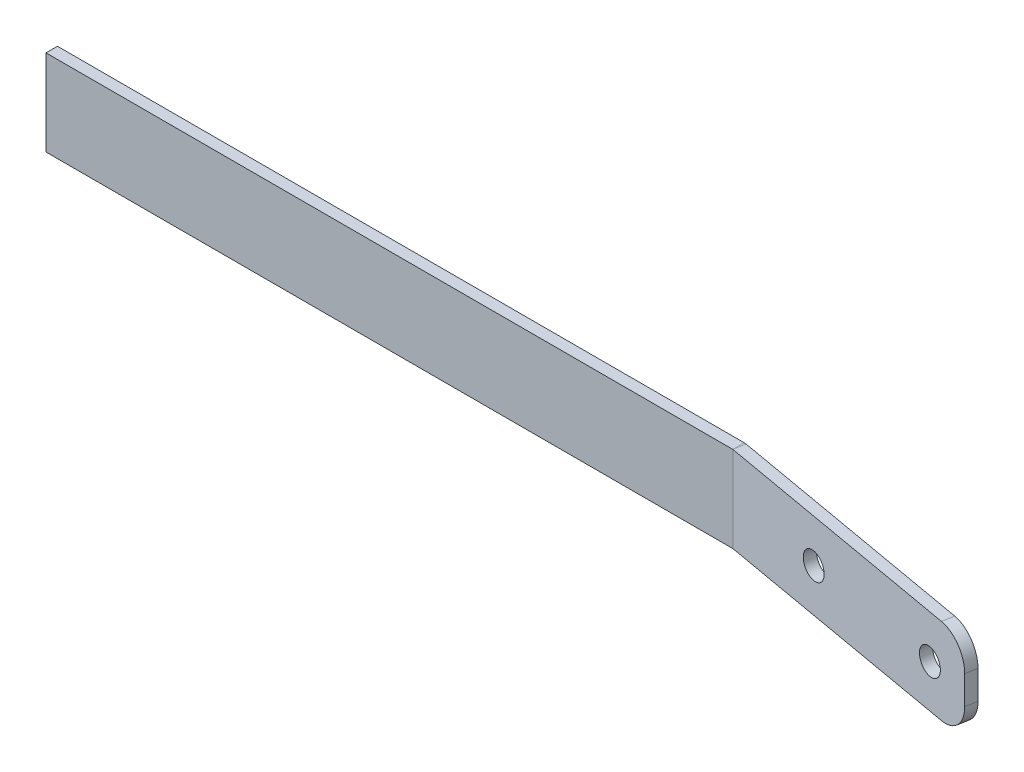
ISO-10303-21;
HEADER;
FILE_DESCRIPTION(('STEP AP214'),'2;1');
FILE_NAME('part.step','',(''),(''),'','','');
FILE_SCHEMA(('AUTOMOTIVE_DESIGN { 1 0 10303 214 1 1 1 1 }'));
ENDSEC;
DATA;
#1=APPLICATION_CONTEXT('core data for automotive mechanical design processes');
#2=APPLICATION_PROTOCOL_DEFINITION('international standard','automotive_design',2000,#1);
#3=PRODUCT_CONTEXT('',#1,'mechanical');
#4=PRODUCT('Part','Part','',(#3));
#5=PRODUCT_RELATED_PRODUCT_CATEGORY('part','',(#4));
#6=PRODUCT_DEFINITION_FORMATION('','',#4);
#7=PRODUCT_DEFINITION_CONTEXT('part definition',#1,'design');
#8=PRODUCT_DEFINITION('design','',#6,#7);
#9=PRODUCT_DEFINITION_SHAPE('','',#8);
#10=(LENGTH_UNIT() NAMED_UNIT(*) SI_UNIT(.MILLI.,.METRE.));
#11=(NAMED_UNIT(*) PLANE_ANGLE_UNIT() SI_UNIT($,.RADIAN.));
#12=(NAMED_UNIT(*) SI_UNIT($,.STERADIAN.) SOLID_ANGLE_UNIT());
#13=UNCERTAINTY_MEASURE_WITH_UNIT(LENGTH_MEASURE(1.E-05),#10,'distance_accuracy_value','');
#14=(GEOMETRIC_REPRESENTATION_CONTEXT(3) GLOBAL_UNCERTAINTY_ASSIGNED_CONTEXT((#13)) GLOBAL_UNIT_ASSIGNED_CONTEXT((#10,
#11,#12)) REPRESENTATION_CONTEXT('',''));
#15=CARTESIAN_POINT('',(0.,0.,0.));
#16=DIRECTION('',(0.,0.,1.));
#17=DIRECTION('',(1.,0.,0.));
#18=AXIS2_PLACEMENT_3D('',#15,#16,#17);
#19=CARTESIAN_POINT('',(3.28628346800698,-15.,17.59802866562));
#20=DIRECTION('',(0.,-1.,0.));
#21=DIRECTION('',(0.984807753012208,0.,0.173648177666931));
#22=AXIS2_PLACEMENT_3D('',#19,#20,#21);
#23=PLANE('',#22);
#24=DIRECTION('',(-0.984807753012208,0.,-0.173648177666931));
#25=VECTOR('',#24,1.);
#26=CARTESIAN_POINT('',(3.28628346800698,-15.,17.59802866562));
#27=LINE('',#26,#25);
#28=CARTESIAN_POINT('',(3.28628346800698,-15.,17.59802866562));
#29=VERTEX_POINT('',#28);
#30=CARTESIAN_POINT('',(-85.1745329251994,-15.,2.));
#31=VERTEX_POINT('',#30);
#32=EDGE_CURVE('E145',#29,#31,#27,.T.);
#33=ORIENTED_EDGE('',*,*,#32,.T.);
#34=DIRECTION('',(0.173648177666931,0.,-0.984807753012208));
#35=VECTOR('',#34,1.);
#36=CARTESIAN_POINT('',(-85.1745329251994,-15.,2.));
#37=LINE('',#36,#35);
#38=CARTESIAN_POINT('',(-84.4799402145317,-15.,-1.93923101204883));
#39=VERTEX_POINT('',#38);
#40=EDGE_CURVE('E11',#31,#39,#37,.T.);
#41=ORIENTED_EDGE('',*,*,#40,.T.);
#42=DIRECTION('',(-0.984807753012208,0.,-0.173648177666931));
#43=VECTOR('',#42,1.);
#44=CARTESIAN_POINT('',(3.9808761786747,-15.,13.6587976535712));
#45=LINE('',#44,#43);
#46=CARTESIAN_POINT('',(3.9808761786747,-15.,13.6587976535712));
#47=VERTEX_POINT('',#46);
#48=EDGE_CURVE('E166',#47,#39,#45,.T.);
#49=ORIENTED_EDGE('',*,*,#48,.F.);
#50=DIRECTION('',(0.173648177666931,0.,-0.984807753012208));
#51=VECTOR('',#50,1.);
#52=CARTESIAN_POINT('',(3.28628346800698,-15.,17.59802866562));
#53=LINE('',#52,#51);
#54=EDGE_CURVE('E155',#29,#47,#53,.T.);
#55=ORIENTED_EDGE('',*,*,#54,.F.);
#56=EDGE_LOOP('',(#33,#41,#49,#55));
#57=FACE_BOUND('',#56,.T.);
#58=ADVANCED_FACE('F30',(#57),#23,.T.);
#59=CARTESIAN_POINT('',(-321.700275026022,14.9999999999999,-39.7058699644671));
#60=DIRECTION('',(0.,1.,0.));
#61=DIRECTION('',(-0.984807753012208,0.,-0.173648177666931));
#62=AXIS2_PLACEMENT_3D('',#59,#60,#61);
#63=PLANE('',#62);
#64=DIRECTION('',(0.984807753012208,0.,0.173648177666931));
#65=VECTOR('',#64,1.);
#66=CARTESIAN_POINT('',(-321.005682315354,14.9999999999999,-43.645100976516));
#67=LINE('',#66,#65);
#68=CARTESIAN_POINT('',(-84.4799402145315,14.9999999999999,-1.9392310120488));
#69=VERTEX_POINT('',#68);
#70=CARTESIAN_POINT('',(3.9808761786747,14.9999999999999,13.6587976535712));
#71=VERTEX_POINT('',#70);
#72=EDGE_CURVE('E138',#69,#71,#67,.T.);
#73=ORIENTED_EDGE('',*,*,#72,.F.);
#74=DIRECTION('',(-0.173648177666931,0.,0.984807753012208));
#75=VECTOR('',#74,1.);
#76=CARTESIAN_POINT('',(-85.1745329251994,14.9999999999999,2.));
#77=LINE('',#76,#75);
#78=CARTESIAN_POINT('',(-85.1745329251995,14.9999999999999,1.99999999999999));
#79=VERTEX_POINT('',#78);
#80=EDGE_CURVE('E38',#69,#79,#77,.T.);
#81=ORIENTED_EDGE('',*,*,#80,.T.);
#82=DIRECTION('',(0.984807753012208,0.,0.173648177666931));
#83=VECTOR('',#82,1.);
#84=CARTESIAN_POINT('',(-321.700275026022,14.9999999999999,-39.7058699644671));
#85=LINE('',#84,#83);
#86=CARTESIAN_POINT('',(3.28628346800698,14.9999999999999,17.59802866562));
#87=VERTEX_POINT('',#86);
#88=EDGE_CURVE('E53',#79,#87,#85,.T.);
#89=ORIENTED_EDGE('',*,*,#88,.T.);
#90=DIRECTION('',(0.173648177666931,0.,-0.984807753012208));
#91=VECTOR('',#90,1.);
#92=CARTESIAN_POINT('',(3.28628346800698,14.9999999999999,17.59802866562));
#93=LINE('',#92,#91);
#94=EDGE_CURVE('E153',#87,#71,#93,.T.);
#95=ORIENTED_EDGE('',*,*,#94,.T.);
#96=EDGE_LOOP('',(#73,#81,#89,#95));
#97=FACE_BOUND('',#96,.T.);
#98=ADVANCED_FACE('F137',(#97),#63,.T.);
#99=CARTESIAN_POINT('',(3.9808761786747,4.99999999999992,13.6587976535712));
#100=DIRECTION('',(0.173648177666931,0.,-0.984807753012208));
#101=DIRECTION('',(-0.984807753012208,0.,-0.173648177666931));
#102=AXIS2_PLACEMENT_3D('',#99,#100,#101);
#103=PLANE('',#102);
#104=CARTESIAN_POINT('',(-50.1835502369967,0.,4.10814788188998));
#105=DIRECTION('',(-0.173648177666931,0.,0.984807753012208));
#106=DIRECTION('',(0.984807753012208,0.,0.173648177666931));
#107=AXIS2_PLACEMENT_3D('',#104,#105,#106);
#108=CIRCLE('',#107,4.5);
#109=CARTESIAN_POINT('',(-45.7519153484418,0.,4.88956468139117));
#110=VERTEX_POINT('',#109);
#111=EDGE_CURVE('E174',#110,#110,#108,.T.);
#112=ORIENTED_EDGE('',*,*,#111,.T.);
#113=EDGE_LOOP('',(#112));
#114=FACE_BOUND('',#113,.T.);
#115=CARTESIAN_POINT('',(-0.943162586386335,0.,12.7905567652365));
#116=DIRECTION('',(-0.173648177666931,0.,0.984807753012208));
#117=DIRECTION('',(0.984807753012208,0.,0.173648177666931));
#118=AXIS2_PLACEMENT_3D('',#115,#116,#117);
#119=CIRCLE('',#118,4.5);
#120=CARTESIAN_POINT('',(3.4884723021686,0.,13.5719735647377));
#121=VERTEX_POINT('',#120);
#122=EDGE_CURVE('E183',#121,#121,#119,.T.);
#123=ORIENTED_EDGE('',*,*,#122,.T.);
#124=EDGE_LOOP('',(#123));
#125=FACE_BOUND('',#124,.T.);
#126=ORIENTED_EDGE('',*,*,#48,.T.);
#127=DIRECTION('',(0.,1.,0.));
#128=VECTOR('',#127,1.);
#129=CARTESIAN_POINT('',(-84.4799402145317,4.99999999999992,-1.93923101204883));
#130=LINE('',#129,#128);
#131=EDGE_CURVE('E126',#39,#69,#130,.T.);
#132=ORIENTED_EDGE('',*,*,#131,.T.);
#133=ORIENTED_EDGE('',*,*,#72,.T.);
#134=CARTESIAN_POINT('',(3.9808761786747,4.99999999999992,13.6587976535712));
#135=DIRECTION('',(0.173648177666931,0.,-0.984807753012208));
#136=DIRECTION('',(-0.984807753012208,0.,-0.173648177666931));
#137=AXIS2_PLACEMENT_3D('',#134,#135,#136);
#138=CIRCLE('',#137,10.);
#139=CARTESIAN_POINT('',(13.8289537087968,4.99999999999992,15.3952794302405));
#140=VERTEX_POINT('',#139);
#141=EDGE_CURVE('E189',#71,#140,#138,.T.);
#142=ORIENTED_EDGE('',*,*,#141,.T.);
#143=DIRECTION('',(0.,1.,0.));
#144=VECTOR('',#143,1.);
#145=CARTESIAN_POINT('',(13.8289537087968,-4.99999999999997,15.3952794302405));
#146=LINE('',#145,#144);
#147=CARTESIAN_POINT('',(13.8289537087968,-4.99999999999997,15.3952794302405));
#148=VERTEX_POINT('',#147);
#149=EDGE_CURVE('E191',#148,#140,#146,.T.);
#150=ORIENTED_EDGE('',*,*,#149,.F.);
#151=CARTESIAN_POINT('',(3.9808761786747,-4.99999999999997,13.6587976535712));
#152=DIRECTION('',(-0.173648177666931,0.,0.984807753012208));
#153=DIRECTION('',(0.984807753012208,0.,0.173648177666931));
#154=AXIS2_PLACEMENT_3D('',#151,#152,#153);
#155=CIRCLE('',#154,10.);
#156=EDGE_CURVE('E194',#47,#148,#155,.T.);
#157=ORIENTED_EDGE('',*,*,#156,.F.);
#158=EDGE_LOOP('',(#126,#132,#133,#142,#150,#157));
#159=FACE_BOUND('',#158,.T.);
#160=ADVANCED_FACE('F162',(#114,#125,#159),#103,.T.);
#161=CARTESIAN_POINT('',(3.28628346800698,4.99999999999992,17.59802866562));
#162=DIRECTION('',(0.173648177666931,0.,-0.984807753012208));
#163=DIRECTION('',(-0.984807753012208,0.,-0.173648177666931));
#164=AXIS2_PLACEMENT_3D('',#161,#162,#163);
#165=PLANE('',#164);
#166=DIRECTION('',(0.,1.,0.));
#167=VECTOR('',#166,1.);
#168=CARTESIAN_POINT('',(-85.1745329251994,4.99999999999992,2.));
#169=LINE('',#168,#167);
#170=EDGE_CURVE('E120',#31,#79,#169,.T.);
#171=ORIENTED_EDGE('',*,*,#170,.F.);
#172=ORIENTED_EDGE('',*,*,#32,.F.);
#173=CARTESIAN_POINT('',(3.28628346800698,-4.99999999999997,17.59802866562));
#174=DIRECTION('',(-0.173648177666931,0.,0.984807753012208));
#175=DIRECTION('',(0.984807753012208,0.,0.173648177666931));
#176=AXIS2_PLACEMENT_3D('',#173,#174,#175);
#177=CIRCLE('',#176,10.);
#178=CARTESIAN_POINT('',(13.1343609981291,-4.99999999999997,19.3345104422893));
#179=VERTEX_POINT('',#178);
#180=EDGE_CURVE('E149',#29,#179,#177,.T.);
#181=ORIENTED_EDGE('',*,*,#180,.T.);
#182=DIRECTION('',(0.,1.,0.));
#183=VECTOR('',#182,1.);
#184=CARTESIAN_POINT('',(13.1343609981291,-4.99999999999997,19.3345104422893));
#185=LINE('',#184,#183);
#186=CARTESIAN_POINT('',(13.1343609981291,4.99999999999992,19.3345104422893));
#187=VERTEX_POINT('',#186);
#188=EDGE_CURVE('E199',#179,#187,#185,.T.);
#189=ORIENTED_EDGE('',*,*,#188,.T.);
#190=CARTESIAN_POINT('',(3.28628346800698,4.99999999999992,17.59802866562));
#191=DIRECTION('',(0.173648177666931,0.,-0.984807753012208));
#192=DIRECTION('',(-0.984807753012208,0.,-0.173648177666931));
#193=AXIS2_PLACEMENT_3D('',#190,#191,#192);
#194=CIRCLE('',#193,10.);
#195=EDGE_CURVE('E143',#87,#187,#194,.T.);
#196=ORIENTED_EDGE('',*,*,#195,.F.);
#197=ORIENTED_EDGE('',*,*,#88,.F.);
#198=EDGE_LOOP('',(#171,#172,#181,#189,#196,#197));
#199=FACE_BOUND('',#198,.T.);
#200=CARTESIAN_POINT('',(-1.63775529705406,0.,16.7297877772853));
#201=DIRECTION('',(-0.173648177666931,0.,0.984807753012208));
#202=DIRECTION('',(0.984807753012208,0.,0.173648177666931));
#203=AXIS2_PLACEMENT_3D('',#200,#201,#202);
#204=CIRCLE('',#203,4.5);
#205=CARTESIAN_POINT('',(2.79387959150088,0.,17.5112045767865));
#206=VERTEX_POINT('',#205);
#207=EDGE_CURVE('E186',#206,#206,#204,.T.);
#208=ORIENTED_EDGE('',*,*,#207,.F.);
#209=EDGE_LOOP('',(#208));
#210=FACE_BOUND('',#209,.T.);
#211=CARTESIAN_POINT('',(-50.8781429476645,0.,8.04737889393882));
#212=DIRECTION('',(-0.173648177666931,0.,0.984807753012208));
#213=DIRECTION('',(0.984807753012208,0.,0.173648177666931));
#214=AXIS2_PLACEMENT_3D('',#211,#212,#213);
#215=CIRCLE('',#214,4.5);
#216=CARTESIAN_POINT('',(-46.4465080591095,0.,8.82879569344));
#217=VERTEX_POINT('',#216);
#218=EDGE_CURVE('E177',#217,#217,#215,.T.);
#219=ORIENTED_EDGE('',*,*,#218,.F.);
#220=EDGE_LOOP('',(#219));
#221=FACE_BOUND('',#220,.T.);
#222=ADVANCED_FACE('F140',(#199,#210,#221),#165,.F.);
#223=CARTESIAN_POINT('',(3.28628346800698,4.99999999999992,17.59802866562));
#224=DIRECTION('',(0.173648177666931,0.,-0.984807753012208));
#225=DIRECTION('',(-0.984807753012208,0.,-0.173648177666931));
#226=AXIS2_PLACEMENT_3D('',#223,#224,#225);
#227=CYLINDRICAL_SURFACE('',#226,10.);
#228=ORIENTED_EDGE('',*,*,#141,.F.);
#229=ORIENTED_EDGE('',*,*,#94,.F.);
#230=ORIENTED_EDGE('',*,*,#195,.T.);
#231=DIRECTION('',(0.173648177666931,0.,-0.984807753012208));
#232=VECTOR('',#231,1.);
#233=CARTESIAN_POINT('',(13.1343609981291,4.99999999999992,19.3345104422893));
#234=LINE('',#233,#232);
#235=EDGE_CURVE('E144',#187,#140,#234,.T.);
#236=ORIENTED_EDGE('',*,*,#235,.T.);
#237=EDGE_LOOP('',(#228,#229,#230,#236));
#238=FACE_BOUND('',#237,.T.);
#239=ADVANCED_FACE('F32',(#238),#227,.T.);
#240=CARTESIAN_POINT('',(3.28628346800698,-4.99999999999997,17.59802866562));
#241=DIRECTION('',(0.173648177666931,0.,-0.984807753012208));
#242=DIRECTION('',(-0.984807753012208,0.,-0.173648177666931));
#243=AXIS2_PLACEMENT_3D('',#240,#241,#242);
#244=CYLINDRICAL_SURFACE('',#243,10.);
#245=ORIENTED_EDGE('',*,*,#156,.T.);
#246=DIRECTION('',(0.173648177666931,0.,-0.984807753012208));
#247=VECTOR('',#246,1.);
#248=CARTESIAN_POINT('',(13.1343609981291,-4.99999999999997,19.3345104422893));
#249=LINE('',#248,#247);
#250=EDGE_CURVE('E147',#179,#148,#249,.T.);
#251=ORIENTED_EDGE('',*,*,#250,.F.);
#252=ORIENTED_EDGE('',*,*,#180,.F.);
#253=ORIENTED_EDGE('',*,*,#54,.T.);
#254=EDGE_LOOP('',(#245,#251,#252,#253));
#255=FACE_BOUND('',#254,.T.);
#256=ADVANCED_FACE('F205',(#255),#244,.T.);
#257=CARTESIAN_POINT('',(13.1343609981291,-4.99999999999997,19.3345104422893));
#258=DIRECTION('',(-0.984807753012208,0.,-0.173648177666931));
#259=DIRECTION('',(-0.173648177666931,0.,0.984807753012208));
#260=AXIS2_PLACEMENT_3D('',#257,#258,#259);
#261=PLANE('',#260);
#262=ORIENTED_EDGE('',*,*,#149,.T.);
#263=ORIENTED_EDGE('',*,*,#235,.F.);
#264=ORIENTED_EDGE('',*,*,#188,.F.);
#265=ORIENTED_EDGE('',*,*,#250,.T.);
#266=EDGE_LOOP('',(#262,#263,#264,#265));
#267=FACE_BOUND('',#266,.T.);
#268=ADVANCED_FACE('F208',(#267),#261,.F.);
#269=CARTESIAN_POINT('',(-1.63775529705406,0.,16.7297877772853));
#270=DIRECTION('',(0.173648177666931,0.,-0.984807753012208));
#271=DIRECTION('',(-0.984807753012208,0.,-0.173648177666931));
#272=AXIS2_PLACEMENT_3D('',#269,#270,#271);
#273=CYLINDRICAL_SURFACE('',#272,4.5);
#274=ORIENTED_EDGE('',*,*,#207,.T.);
#275=EDGE_LOOP('',(#274));
#276=FACE_BOUND('',#275,.T.);
#277=ORIENTED_EDGE('',*,*,#122,.F.);
#278=EDGE_LOOP('',(#277));
#279=FACE_BOUND('',#278,.T.);
#280=ADVANCED_FACE('F225',(#276,#279),#273,.F.);
#281=CARTESIAN_POINT('',(-50.8781429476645,0.,8.04737889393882));
#282=DIRECTION('',(0.173648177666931,0.,-0.984807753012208));
#283=DIRECTION('',(-0.984807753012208,0.,-0.173648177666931));
#284=AXIS2_PLACEMENT_3D('',#281,#282,#283);
#285=CYLINDRICAL_SURFACE('',#284,4.5);
#286=ORIENTED_EDGE('',*,*,#218,.T.);
#287=EDGE_LOOP('',(#286));
#288=FACE_BOUND('',#287,.T.);
#289=ORIENTED_EDGE('',*,*,#111,.F.);
#290=EDGE_LOOP('',(#289));
#291=FACE_BOUND('',#290,.T.);
#292=ADVANCED_FACE('F229',(#288,#291),#285,.F.);
#293=CARTESIAN_POINT('',(5.,4.99999999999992,2.));
#294=DIRECTION('',(0.,0.,-1.));
#295=DIRECTION('',(-1.,0.,0.));
#296=AXIS2_PLACEMENT_3D('',#293,#294,#295);
#297=PLANE('',#296);
#298=DIRECTION('',(-1.,0.,0.));
#299=VECTOR('',#298,1.);
#300=CARTESIAN_POINT('',(4.99999999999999,-15.,2.));
#301=LINE('',#300,#299);
#302=CARTESIAN_POINT('',(-325.,-15.,2.));
#303=VERTEX_POINT('',#302);
#304=EDGE_CURVE('E122',#31,#303,#301,.T.);
#305=ORIENTED_EDGE('',*,*,#304,.F.);
#306=ORIENTED_EDGE('',*,*,#170,.T.);
#307=DIRECTION('',(1.,0.,0.));
#308=VECTOR('',#307,1.);
#309=CARTESIAN_POINT('',(-325.,14.9999999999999,2.));
#310=LINE('',#309,#308);
#311=CARTESIAN_POINT('',(-325.,14.9999999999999,2.));
#312=VERTEX_POINT('',#311);
#313=EDGE_CURVE('E104',#312,#79,#310,.T.);
#314=ORIENTED_EDGE('',*,*,#313,.F.);
#315=DIRECTION('',(0.,-1.,0.));
#316=VECTOR('',#315,1.);
#317=CARTESIAN_POINT('',(-325.,14.9999999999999,2.));
#318=LINE('',#317,#316);
#319=EDGE_CURVE('E116',#312,#303,#318,.T.);
#320=ORIENTED_EDGE('',*,*,#319,.T.);
#321=EDGE_LOOP('',(#305,#306,#314,#320));
#322=FACE_BOUND('',#321,.T.);
#323=ADVANCED_FACE('F121',(#322),#297,.F.);
#324=CARTESIAN_POINT('',(5.,4.99999999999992,-2.));
#325=DIRECTION('',(0.,0.,-1.));
#326=DIRECTION('',(-1.,0.,0.));
#327=AXIS2_PLACEMENT_3D('',#324,#325,#326);
#328=PLANE('',#327);
#329=DIRECTION('',(0.,1.,0.));
#330=VECTOR('',#329,1.);
#331=CARTESIAN_POINT('',(-85.1745329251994,4.99999999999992,-2.));
#332=LINE('',#331,#330);
#333=CARTESIAN_POINT('',(-85.1745329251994,-15.,-2.));
#334=VERTEX_POINT('',#333);
#335=CARTESIAN_POINT('',(-85.1745329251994,14.9999999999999,-2.));
#336=VERTEX_POINT('',#335);
#337=EDGE_CURVE('E134',#334,#336,#332,.T.);
#338=ORIENTED_EDGE('',*,*,#337,.F.);
#339=DIRECTION('',(-1.,0.,0.));
#340=VECTOR('',#339,1.);
#341=CARTESIAN_POINT('',(4.99999999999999,-15.,-2.));
#342=LINE('',#341,#340);
#343=CARTESIAN_POINT('',(-325.,-15.,-2.));
#344=VERTEX_POINT('',#343);
#345=EDGE_CURVE('E358',#334,#344,#342,.T.);
#346=ORIENTED_EDGE('',*,*,#345,.T.);
#347=DIRECTION('',(0.,-1.,0.));
#348=VECTOR('',#347,1.);
#349=CARTESIAN_POINT('',(-325.,14.9999999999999,-2.));
#350=LINE('',#349,#348);
#351=CARTESIAN_POINT('',(-325.,14.9999999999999,-2.));
#352=VERTEX_POINT('',#351);
#353=EDGE_CURVE('E355',#352,#344,#350,.T.);
#354=ORIENTED_EDGE('',*,*,#353,.F.);
#355=DIRECTION('',(1.,0.,0.));
#356=VECTOR('',#355,1.);
#357=CARTESIAN_POINT('',(-325.,14.9999999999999,-2.));
#358=LINE('',#357,#356);
#359=EDGE_CURVE('E357',#352,#336,#358,.T.);
#360=ORIENTED_EDGE('',*,*,#359,.T.);
#361=EDGE_LOOP('',(#338,#346,#354,#360));
#362=FACE_BOUND('',#361,.T.);
#363=ADVANCED_FACE('F289',(#362),#328,.T.);
#364=CARTESIAN_POINT('',(-325.,14.9999999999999,2.));
#365=DIRECTION('',(0.,1.,0.));
#366=DIRECTION('',(-1.,0.,0.));
#367=AXIS2_PLACEMENT_3D('',#364,#365,#366);
#368=PLANE('',#367);
#369=DIRECTION('',(0.,0.,1.));
#370=VECTOR('',#369,1.);
#371=CARTESIAN_POINT('',(-85.1745329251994,14.9999999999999,2.));
#372=LINE('',#371,#370);
#373=EDGE_CURVE('E109',#336,#79,#372,.T.);
#374=ORIENTED_EDGE('',*,*,#373,.F.);
#375=ORIENTED_EDGE('',*,*,#359,.F.);
#376=DIRECTION('',(0.,0.,-1.));
#377=VECTOR('',#376,1.);
#378=CARTESIAN_POINT('',(-325.,14.9999999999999,2.));
#379=LINE('',#378,#377);
#380=EDGE_CURVE('E111',#312,#352,#379,.T.);
#381=ORIENTED_EDGE('',*,*,#380,.F.);
#382=ORIENTED_EDGE('',*,*,#313,.T.);
#383=EDGE_LOOP('',(#374,#375,#381,#382));
#384=FACE_BOUND('',#383,.T.);
#385=ADVANCED_FACE('F106',(#384),#368,.T.);
#386=CARTESIAN_POINT('',(-325.,14.9999999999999,2.));
#387=DIRECTION('',(1.,0.,0.));
#388=DIRECTION('',(0.,1.,0.));
#389=AXIS2_PLACEMENT_3D('',#386,#387,#388);
#390=PLANE('',#389);
#391=ORIENTED_EDGE('',*,*,#353,.T.);
#392=DIRECTION('',(0.,0.,-1.));
#393=VECTOR('',#392,1.);
#394=CARTESIAN_POINT('',(-325.,-15.,2.));
#395=LINE('',#394,#393);
#396=EDGE_CURVE('E115',#303,#344,#395,.T.);
#397=ORIENTED_EDGE('',*,*,#396,.F.);
#398=ORIENTED_EDGE('',*,*,#319,.F.);
#399=ORIENTED_EDGE('',*,*,#380,.T.);
#400=EDGE_LOOP('',(#391,#397,#398,#399));
#401=FACE_BOUND('',#400,.T.);
#402=ADVANCED_FACE('F307',(#401),#390,.F.);
#403=CARTESIAN_POINT('',(4.99999999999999,-15.,2.));
#404=DIRECTION('',(0.,-1.,0.));
#405=DIRECTION('',(1.,0.,0.));
#406=AXIS2_PLACEMENT_3D('',#403,#404,#405);
#407=PLANE('',#406);
#408=DIRECTION('',(0.,0.,-1.));
#409=VECTOR('',#408,1.);
#410=CARTESIAN_POINT('',(-85.1745329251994,-15.,2.));
#411=LINE('',#410,#409);
#412=EDGE_CURVE('E133',#31,#334,#411,.T.);
#413=ORIENTED_EDGE('',*,*,#412,.F.);
#414=ORIENTED_EDGE('',*,*,#304,.T.);
#415=ORIENTED_EDGE('',*,*,#396,.T.);
#416=ORIENTED_EDGE('',*,*,#345,.F.);
#417=EDGE_LOOP('',(#413,#414,#415,#416));
#418=FACE_BOUND('',#417,.T.);
#419=ADVANCED_FACE('F316',(#418),#407,.T.);
#420=CARTESIAN_POINT('',(-85.1745329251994,-15.,2.));
#421=DIRECTION('',(0.,-1.,0.));
#422=DIRECTION('',(0.,0.,-1.));
#423=AXIS2_PLACEMENT_3D('',#420,#421,#422);
#424=PLANE('',#423);
#425=ORIENTED_EDGE('',*,*,#40,.F.);
#426=ORIENTED_EDGE('',*,*,#412,.T.);
#427=CARTESIAN_POINT('',(-85.1745329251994,-15.,2.));
#428=DIRECTION('',(0.,-1.,0.));
#429=DIRECTION('',(0.,0.,-1.));
#430=AXIS2_PLACEMENT_3D('',#427,#428,#429);
#431=CIRCLE('',#430,4.);
#432=EDGE_CURVE('E45',#39,#334,#431,.F.);
#433=ORIENTED_EDGE('',*,*,#432,.F.);
#434=EDGE_LOOP('',(#425,#426,#433));
#435=FACE_BOUND('',#434,.T.);
#436=ADVANCED_FACE('F171',(#435),#424,.T.);
#437=CARTESIAN_POINT('',(-85.1745329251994,14.9999999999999,2.));
#438=DIRECTION('',(0.,1.,0.));
#439=DIRECTION('',(0.,0.,1.));
#440=AXIS2_PLACEMENT_3D('',#437,#438,#439);
#441=PLANE('',#440);
#442=ORIENTED_EDGE('',*,*,#373,.T.);
#443=ORIENTED_EDGE('',*,*,#80,.F.);
#444=CARTESIAN_POINT('',(-85.1745329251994,14.9999999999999,2.));
#445=DIRECTION('',(0.,1.,0.));
#446=DIRECTION('',(0.,0.,1.));
#447=AXIS2_PLACEMENT_3D('',#444,#445,#446);
#448=CIRCLE('',#447,4.);
#449=EDGE_CURVE('E132',#336,#69,#448,.F.);
#450=ORIENTED_EDGE('',*,*,#449,.F.);
#451=EDGE_LOOP('',(#442,#443,#450));
#452=FACE_BOUND('',#451,.T.);
#453=ADVANCED_FACE('F130',(#452),#441,.T.);
#454=CARTESIAN_POINT('',(-85.1745329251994,-356.449503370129,2.));
#455=DIRECTION('',(0.,1.,0.));
#456=DIRECTION('',(0.,0.,1.));
#457=AXIS2_PLACEMENT_3D('',#454,#455,#456);
#458=CYLINDRICAL_SURFACE('',#457,4.);
#459=ORIENTED_EDGE('',*,*,#337,.T.);
#460=ORIENTED_EDGE('',*,*,#449,.T.);
#461=ORIENTED_EDGE('',*,*,#131,.F.);
#462=ORIENTED_EDGE('',*,*,#432,.T.);
#463=EDGE_LOOP('',(#459,#460,#461,#462));
#464=FACE_BOUND('',#463,.T.);
#465=ADVANCED_FACE('F169',(#464),#458,.T.);
#466=CLOSED_SHELL('',(#58,#98,#160,#222,#239,#256,#268,#280,#292,#323,#363,#385,#402,#419,#436,
#453,#465));
#467=MANIFOLD_SOLID_BREP('B2',#466);
#468=ADVANCED_BREP_SHAPE_REPRESENTATION('',(#18,#467),#14);
#469=SHAPE_DEFINITION_REPRESENTATION(#9,#468);
ENDSEC;
END-ISO-10303-21;
